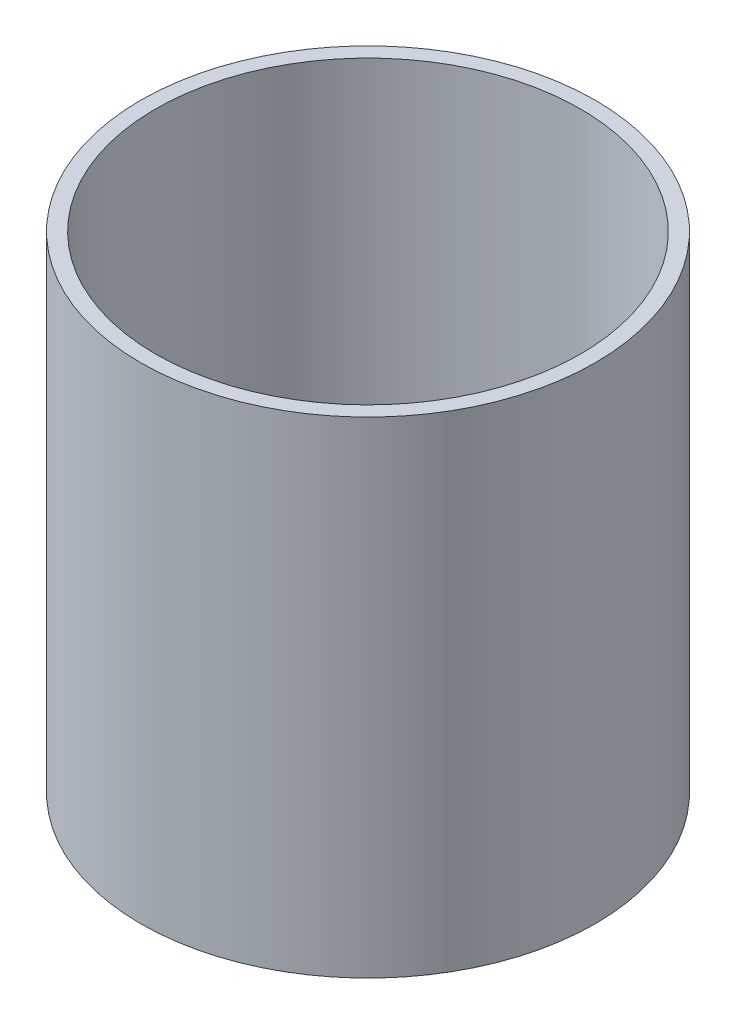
from build123d import *

# Parameters (mm, degrees)
SKETCH1_R           = 83.185
SKETCH1_R_2         = 77.724
BOSS_EXTRUDE1_DEPTH = 177.8


with BuildPart() as part:
    # Sketch1 → Boss-Extrude1 (new body)
    with BuildSketch(Plane(origin=(0, 0, 0), x_dir=(1, 0, 0), z_dir=(0, 1, 0))):
        with Locations(Location((0, 0, 0), (0, 0, 270))):
            Circle(SKETCH1_R)
        with Locations(Location((0, 0, 0), (0, 0, 270))):
            Circle(SKETCH1_R_2, mode=Mode.SUBTRACT)
    extrude(amount=BOSS_EXTRUDE1_DEPTH)


solid = part.part
